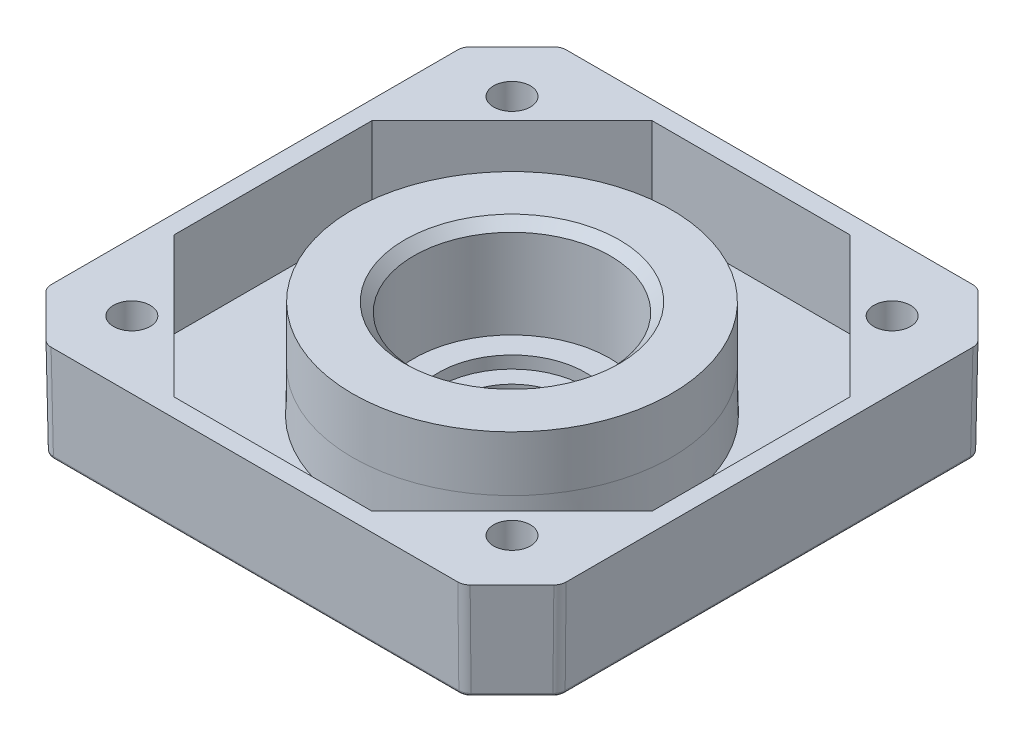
from build123d import *

# Parameters (mm, degrees)
BOSS_EXTRUDE1_DEPTH = 8
BOSS_EXTRUDE1_DRAFT = -1
SKETCH14_R          = 11
BOSS_EXTRUDE8_DEPTH = 2
FILLET2_R           = 1
CUT_EXTRUDE1_DEPTH  = 7
BOSS_EXTRUDE5_REACH = 36.012
BOSS_EXTRUDE5_START = 3.5
SKETCH6_R           = 13
BOSS_EXTRUDE5_DRAFT = 1
SKETCH7_R           = 13
BOSS_EXTRUDE6_DEPTH = 4.5
SKETCH15_R          = 1.5
CUT_EXTRUDE7_DEPTH  = 32.336879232
FILLET3_R           = 0.25
FILLET4_R           = 0.25


with BuildPart() as part:
    # Sketch1 → Boss-Extrude1 (with draft: the straight prism first)
    with BuildSketch(Plane(origin=(0, 0, 0), x_dir=(1, 0, 0), z_dir=(0, 1, 0))):
        Polygon((-17, 21), (-21, 17), (-21, -17), (-17, -21), (17, -21), (21, -17), (21, 17), (17, 21), align=None)
    extrude(amount=-BOSS_EXTRUDE1_DEPTH)
    # Boss-Extrude1: the draft: its side faces are tilted about the plane it starts from
    boss_extrude1_sides = [part.faces().sort_by_distance(p)[0] for p in [
        (-19, -4, -19),
        (-21, -4, 0),
        (-19, -4, 19),
        (0, -4, 21),
        (19, -4, 19),
        (21, -4, 0),
        (19, -4, -19),
        (0, -4, -21),
    ]]
    draft(boss_extrude1_sides, Plane(origin=(0, 0, 0), x_dir=(1, 0, 0), z_dir=(0, 1, 0)), BOSS_EXTRUDE1_DRAFT)

    # Sketch14 → Boss-Extrude8 (add)
    with BuildSketch(Plane.XZ.offset(8)):
        with Locations(Location((0, 0, 0), (0, 0, 270))):
            Circle(SKETCH14_R)
    extrude(amount=BOSS_EXTRUDE8_DEPTH)

    # Fillet2
    fillet2_edges = [part.edges().sort_by_distance(p)[0] for p in [
        (16.971079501, -4, -20.93017974),
        (20.93017974, -4, -16.971079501),
        (20.93017974, -4, 16.971079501),
        (16.971079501, -4, 20.93017974),
        (-16.971079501, -4, 20.93017974),
        (-20.93017974, -4, 16.971079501),
        (-20.93017974, -4, -16.971079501),
        (-16.971079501, -4, -20.93017974),
    ]]
    fillet(fillet2_edges, radius=FILLET2_R)

    # Sketch2 → Cut-Extrude1 (cut)
    with BuildSketch(Plane(origin=(0, 0, 0), x_dir=(1, 0, 0), z_dir=(0, 1, 0))):
        Polygon((-8.077164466, 19.5), (-19.5, 8.077164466), (-19.5, -8.077164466), (-8.077164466, -19.5), (8.077164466, -19.5), (19.5, -8.077164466), (19.5, 8.077164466), (8.077164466, 19.5), align=None)
    extrude(amount=-CUT_EXTRUDE1_DEPTH, mode=Mode.SUBTRACT)




with BuildPart() as boss_extrude5_long_prism_1:
    # Sketch6 → Boss-Extrude5 (the long prism of profile 1, to be tilted and cut off)
    with BuildSketch(Plane(origin=(0, -7, 0), x_dir=(1, 0, 0), z_dir=(0, 1, 0)).offset(BOSS_EXTRUDE5_START)):
        Circle(SKETCH6_R)
    extrude(amount=-BOSS_EXTRUDE5_REACH)
    boss_extrude5_tool1_sides = [boss_extrude5_long_prism_1.faces().sort_by_distance(p)[0] for p in [
        (-13, -21.506, 0),
    ]]
    draft(boss_extrude5_tool1_sides, Plane(origin=(0, -7, 0), x_dir=(1, 0, 0), z_dir=(0, 1, 0)).offset(BOSS_EXTRUDE5_START), BOSS_EXTRUDE5_DRAFT)  # the draft: side faces tilted about the start plane


with BuildPart() as part_1:
    add(part.part)
    boss_extrude5_tool1 = boss_extrude5_long_prism_1.part - part.part
    add(boss_extrude5_tool1.solids().sort_by_distance((0, -3.5, 0))[0])

    # Sketch7 → Boss-Extrude6 (add)
    with BuildSketch(Plane(origin=(0, -3.5, 0), x_dir=(1, 0, 0), z_dir=(0, 1, 0))):
        with Locations(Location((0, 0, 0), (0, 0, 270))):
            Circle(SKETCH7_R)
    extrude(amount=BOSS_EXTRUDE6_DEPTH)

    # Sketch9 → Cut-Revolve1 (revolve, cut)
    with BuildSketch(Plane.XY, mode=Mode.PRIVATE) as cut_revolve1_sk:
        with BuildLine():
            Line((6, -7), (6, -8))
            Line((6, -8), (4.5, -8))
            Line((4.5, -8), (4.5, -9.5))
            ThreePointArc((4.5, -9.5), (4.646446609, -9.853553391), (5, -10))
            Line((5, -10), (0, -10))
            Line((0, -10), (0, 1))
            Line((0, 1), (8.75, 1))
            Line((8.75, 1), (8, 0.25))
            Line((8, 0.25), (8, -7))
            Line((8, -7), (6, -7))
        make_face()
    revolve(cut_revolve1_sk.sketch.rotate(Axis((0, 1, 0), (0, -1, 0)), 90), axis=Axis((0, 1, 0), (0, -1, 0)), mode=Mode.SUBTRACT)

    # Sketch15 → Cut-Extrude7 (cut, through all)
    with BuildSketch(Plane(origin=(0, 0, 0), x_dir=(1, 0, 0), z_dir=(0, 1, 0))):
        with Locations(Location((-15.5, 15.5, 0), (0, 0, 270))):
            Circle(SKETCH15_R)
        with Locations(Location((-15.5, -15.5, 0), (0, 0, 270))):
            Circle(SKETCH15_R)
        with Locations(Location((15.5, -15.5, 0), (0, 0, 270))):
            Circle(SKETCH15_R)
        with Locations(Location((15.5, 15.5, 0), (0, 0, 270))):
            Circle(SKETCH15_R)
    extrude(amount=-CUT_EXTRUDE7_DEPTH, mode=Mode.SUBTRACT)

    # Fillet3
    fillet3_edges = [part_1.edges().sort_by_distance(p)[0] for p in [
        (0, -8, 11),
        (0, -10, 11),
    ]]
    fillet(fillet3_edges, radius=FILLET3_R)

    # Fillet4
    fillet4_edges = [part_1.edges().sort_by_distance(p)[0] for p in [
        (-20.860359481, -8, 0),
        (-18.901259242, -8, 18.901259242),
        (0, -8, -20.860359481),
        (18.901259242, -8, -18.901259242),
        (20.860359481, -8, 0),
        (18.901259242, -8, 18.901259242),
        (0, -8, 20.860359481),
        (-18.901259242, -8, -18.901259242),
        (16.910634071, -8, -20.784251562),
        (20.784251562, -8, -16.910634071),
        (-16.910634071, -8, -20.784251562),
        (-20.784251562, -8, -16.910634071),
        (20.784251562, -8, 16.910634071),
        (16.910634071, -8, 20.784251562),
        (-16.910634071, -8, 20.784251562),
        (-20.784251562, -8, 16.910634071),
    ]]
    fillet(fillet4_edges, radius=FILLET4_R)


solid = part_1.part
